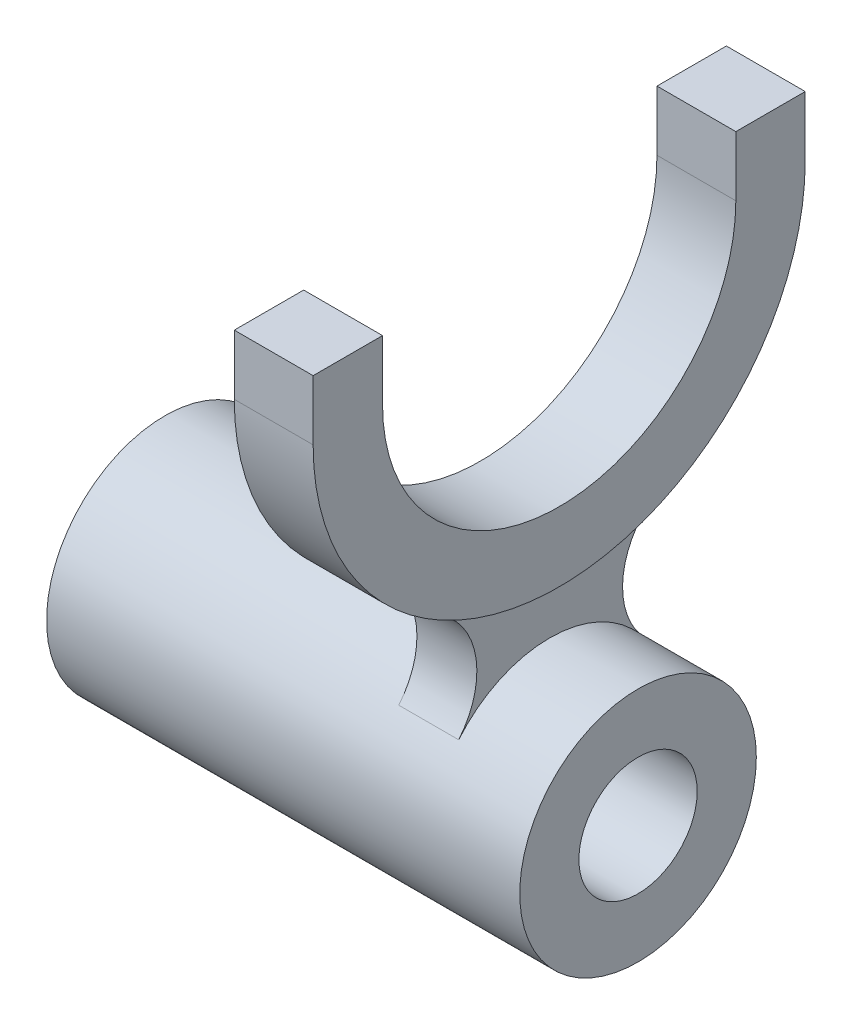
from build123d import *

# Parameters (mm, degrees)
BOSS_EXTRUDE2_DEPTH      = 19.05
BOSS_EXTRUDE2_DEPTH_BACK = 57.15
SKETCH1_R                = 19.05
SKETCH1_R_2              = 9.525
EXTRUDE_THIN1_DEPTH      = 6.35
BOSS_EXTRUDE3_DEPTH      = 4.826


with BuildPart() as part:
    # Sketch1 → Boss-Extrude2 (new, two sides: drawn at the far end of the back side and taken through both)
    with BuildSketch(Plane(origin=(0, 0, 0), x_dir=(0, 0, -1), z_dir=(1, 0, 0)).offset(-BOSS_EXTRUDE2_DEPTH_BACK)):
        Circle(SKETCH1_R)
        Circle(SKETCH1_R_2, mode=Mode.SUBTRACT)
    extrude(amount=BOSS_EXTRUDE2_DEPTH + BOSS_EXTRUDE2_DEPTH_BACK)



with BuildPart() as body_2:
    # Sketch3 → Extrude-Thin1 (new, symmetric)
    with BuildSketch(Plane(origin=(0, 0, 0), x_dir=(0, 0, -1), z_dir=(1, 0, 0))):
        with BuildLine():
            Line((-39.624, 76.2), (-39.624, 66.548))
            ThreePointArc((-39.624, 66.548), (0, 26.924), (39.624, 66.548))
            Line((39.624, 66.548), (39.624, 76.2))
            Line((39.624, 76.2), (28.448, 76.2))
            Line((28.448, 76.2), (28.448, 66.548))
            ThreePointArc((28.448, 66.548), (0, 38.1), (-28.448, 66.548))
            Line((-28.448, 66.548), (-28.448, 76.2))
            Line((-28.448, 76.2), (-39.624, 76.2))
        make_face()
    extrude(amount=EXTRUDE_THIN1_DEPTH, both=True)


with BuildPart() as part_1:
    add(part.part)

    add(body_2.part)  # Boss-Extrude3 merges body 2
    # Sketch4 → Boss-Extrude3 (add, symmetric)
    with BuildSketch(Plane(origin=(0, 0, 0), x_dir=(0, 0, -1), z_dir=(1, 0, 0))):
        with BuildLine():
            ThreePointArc((-18.501121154, 31.508452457), (0, 26.924), (18.501121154, 31.508452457))
            ThreePointArc((18.501121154, 31.508452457), (11.974406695, 22.752517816), (14.658580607, 12.166696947))
            ThreePointArc((14.658580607, 12.166696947), (0, 19.05), (-14.658580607, 12.166696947))
            ThreePointArc((-14.658580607, 12.166696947), (-11.974406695, 22.752517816), (-18.501121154, 31.508452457))
        make_face()
    extrude(amount=BOSS_EXTRUDE3_DEPTH, both=True)


solid = part_1.part
